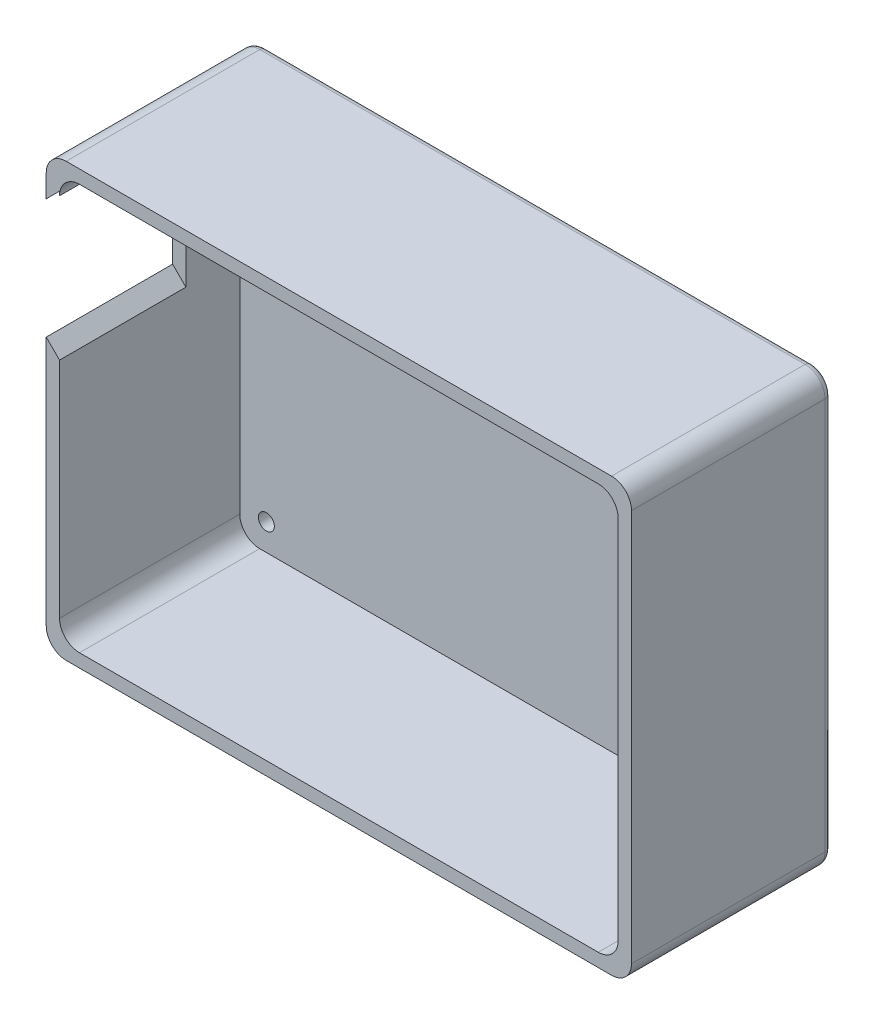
ISO-10303-21;
HEADER;
FILE_DESCRIPTION(('STEP AP214'),'2;1');
FILE_NAME('part.step','',(''),(''),'','','');
FILE_SCHEMA(('AUTOMOTIVE_DESIGN { 1 0 10303 214 1 1 1 1 }'));
ENDSEC;
DATA;
#1=APPLICATION_CONTEXT('core data for automotive mechanical design processes');
#2=APPLICATION_PROTOCOL_DEFINITION('international standard','automotive_design',2000,#1);
#3=PRODUCT_CONTEXT('',#1,'mechanical');
#4=PRODUCT('Part','Part','',(#3));
#5=PRODUCT_RELATED_PRODUCT_CATEGORY('part','',(#4));
#6=PRODUCT_DEFINITION_FORMATION('','',#4);
#7=PRODUCT_DEFINITION_CONTEXT('part definition',#1,'design');
#8=PRODUCT_DEFINITION('design','',#6,#7);
#9=PRODUCT_DEFINITION_SHAPE('','',#8);
#10=(LENGTH_UNIT() NAMED_UNIT(*) SI_UNIT(.MILLI.,.METRE.));
#11=(NAMED_UNIT(*) PLANE_ANGLE_UNIT() SI_UNIT($,.RADIAN.));
#12=(NAMED_UNIT(*) SI_UNIT($,.STERADIAN.) SOLID_ANGLE_UNIT());
#13=UNCERTAINTY_MEASURE_WITH_UNIT(LENGTH_MEASURE(1.E-05),#10,'distance_accuracy_value','');
#14=(GEOMETRIC_REPRESENTATION_CONTEXT(3) GLOBAL_UNCERTAINTY_ASSIGNED_CONTEXT((#13)) GLOBAL_UNIT_ASSIGNED_CONTEXT((#10,
#11,#12)) REPRESENTATION_CONTEXT('',''));
#15=CARTESIAN_POINT('',(0.,0.,0.));
#16=DIRECTION('',(0.,0.,1.));
#17=DIRECTION('',(1.,0.,0.));
#18=AXIS2_PLACEMENT_3D('',#15,#16,#17);
#19=CARTESIAN_POINT('',(82.,0.,3.));
#20=DIRECTION('',(0.,0.,-1.));
#21=DIRECTION('',(-1.,0.,0.));
#22=AXIS2_PLACEMENT_3D('',#19,#20,#21);
#23=CYLINDRICAL_SURFACE('',#22,3.);
#24=DIRECTION('',(0.,0.,-1.));
#25=VECTOR('',#24,1.);
#26=CARTESIAN_POINT('',(82.,-3.,3.));
#27=LINE('',#26,#25);
#28=CARTESIAN_POINT('',(82.,-3.,30.1));
#29=VERTEX_POINT('',#28);
#30=CARTESIAN_POINT('',(82.,-3.,1.));
#31=VERTEX_POINT('',#30);
#32=EDGE_CURVE('E420',#29,#31,#27,.T.);
#33=ORIENTED_EDGE('',*,*,#32,.T.);
#34=CARTESIAN_POINT('',(82.,0.,1.));
#35=DIRECTION('',(0.,0.,-1.));
#36=DIRECTION('',(-1.,0.,0.));
#37=AXIS2_PLACEMENT_3D('',#34,#35,#36);
#38=CIRCLE('',#37,3.);
#39=CARTESIAN_POINT('',(85.,0.,1.));
#40=VERTEX_POINT('',#39);
#41=EDGE_CURVE('E490',#31,#40,#38,.F.);
#42=ORIENTED_EDGE('',*,*,#41,.T.);
#43=DIRECTION('',(0.,0.,-1.));
#44=VECTOR('',#43,1.);
#45=CARTESIAN_POINT('',(85.,0.,3.));
#46=LINE('',#45,#44);
#47=CARTESIAN_POINT('',(85.,0.,30.1));
#48=VERTEX_POINT('',#47);
#49=EDGE_CURVE('E421',#48,#40,#46,.T.);
#50=ORIENTED_EDGE('',*,*,#49,.F.);
#51=CARTESIAN_POINT('',(82.,0.,30.1));
#52=DIRECTION('',(0.,0.,1.));
#53=DIRECTION('',(1.,0.,0.));
#54=AXIS2_PLACEMENT_3D('',#51,#52,#53);
#55=CIRCLE('',#54,3.);
#56=EDGE_CURVE('E363',#29,#48,#55,.T.);
#57=ORIENTED_EDGE('',*,*,#56,.F.);
#58=EDGE_LOOP('',(#33,#42,#50,#57));
#59=FACE_BOUND('',#58,.T.);
#60=ADVANCED_FACE('F39',(#59),#23,.T.);
#61=CARTESIAN_POINT('',(85.,59.,3.));
#62=DIRECTION('',(1.,0.,0.));
#63=DIRECTION('',(0.,0.,-1.));
#64=AXIS2_PLACEMENT_3D('',#61,#62,#63);
#65=PLANE('',#64);
#66=ORIENTED_EDGE('',*,*,#49,.T.);
#67=DIRECTION('',(0.,-1.,0.));
#68=VECTOR('',#67,1.);
#69=CARTESIAN_POINT('',(85.,59.,1.));
#70=LINE('',#69,#68);
#71=CARTESIAN_POINT('',(85.,59.,1.));
#72=VERTEX_POINT('',#71);
#73=EDGE_CURVE('E493',#40,#72,#70,.F.);
#74=ORIENTED_EDGE('',*,*,#73,.T.);
#75=DIRECTION('',(0.,0.,-1.));
#76=VECTOR('',#75,1.);
#77=CARTESIAN_POINT('',(85.,59.,3.));
#78=LINE('',#77,#76);
#79=CARTESIAN_POINT('',(85.,59.,30.1));
#80=VERTEX_POINT('',#79);
#81=EDGE_CURVE('E426',#80,#72,#78,.T.);
#82=ORIENTED_EDGE('',*,*,#81,.F.);
#83=DIRECTION('',(0.,1.,0.));
#84=VECTOR('',#83,1.);
#85=CARTESIAN_POINT('',(85.,0.,30.1));
#86=LINE('',#85,#84);
#87=EDGE_CURVE('E367',#48,#80,#86,.T.);
#88=ORIENTED_EDGE('',*,*,#87,.F.);
#89=EDGE_LOOP('',(#66,#74,#82,#88));
#90=FACE_BOUND('',#89,.T.);
#91=ADVANCED_FACE('F540',(#90),#65,.T.);
#92=CARTESIAN_POINT('',(82.,59.,3.));
#93=DIRECTION('',(0.,0.,-1.));
#94=DIRECTION('',(-1.,0.,0.));
#95=AXIS2_PLACEMENT_3D('',#92,#93,#94);
#96=CYLINDRICAL_SURFACE('',#95,3.);
#97=ORIENTED_EDGE('',*,*,#81,.T.);
#98=CARTESIAN_POINT('',(82.,59.,1.));
#99=DIRECTION('',(0.,0.,-1.));
#100=DIRECTION('',(-1.,0.,0.));
#101=AXIS2_PLACEMENT_3D('',#98,#99,#100);
#102=CIRCLE('',#101,3.);
#103=CARTESIAN_POINT('',(82.,62.,1.));
#104=VERTEX_POINT('',#103);
#105=EDGE_CURVE('E49',#72,#104,#102,.F.);
#106=ORIENTED_EDGE('',*,*,#105,.T.);
#107=DIRECTION('',(0.,0.,-1.));
#108=VECTOR('',#107,1.);
#109=CARTESIAN_POINT('',(82.,62.,3.));
#110=LINE('',#109,#108);
#111=CARTESIAN_POINT('',(82.,62.,30.1));
#112=VERTEX_POINT('',#111);
#113=EDGE_CURVE('E430',#112,#104,#110,.T.);
#114=ORIENTED_EDGE('',*,*,#113,.F.);
#115=CARTESIAN_POINT('',(82.,59.,30.1));
#116=DIRECTION('',(0.,0.,1.));
#117=DIRECTION('',(1.,0.,0.));
#118=AXIS2_PLACEMENT_3D('',#115,#116,#117);
#119=CIRCLE('',#118,3.);
#120=EDGE_CURVE('E339',#80,#112,#119,.T.);
#121=ORIENTED_EDGE('',*,*,#120,.F.);
#122=EDGE_LOOP('',(#97,#106,#114,#121));
#123=FACE_BOUND('',#122,.T.);
#124=ADVANCED_FACE('F545',(#123),#96,.T.);
#125=CARTESIAN_POINT('',(82.,62.,3.));
#126=DIRECTION('',(0.,1.,0.));
#127=DIRECTION('',(0.,0.,1.));
#128=AXIS2_PLACEMENT_3D('',#125,#126,#127);
#129=PLANE('',#128);
#130=ORIENTED_EDGE('',*,*,#113,.T.);
#131=DIRECTION('',(1.,0.,0.));
#132=VECTOR('',#131,1.);
#133=CARTESIAN_POINT('',(82.,62.,1.));
#134=LINE('',#133,#132);
#135=CARTESIAN_POINT('',(0.,62.,1.));
#136=VERTEX_POINT('',#135);
#137=EDGE_CURVE('E11',#104,#136,#134,.F.);
#138=ORIENTED_EDGE('',*,*,#137,.T.);
#139=DIRECTION('',(0.,0.,-1.));
#140=VECTOR('',#139,1.);
#141=CARTESIAN_POINT('',(0.,62.,3.));
#142=LINE('',#141,#140);
#143=CARTESIAN_POINT('',(0.,62.,30.1));
#144=VERTEX_POINT('',#143);
#145=EDGE_CURVE('E434',#144,#136,#142,.T.);
#146=ORIENTED_EDGE('',*,*,#145,.F.);
#147=DIRECTION('',(-1.,0.,0.));
#148=VECTOR('',#147,1.);
#149=CARTESIAN_POINT('',(82.,62.,30.1));
#150=LINE('',#149,#148);
#151=EDGE_CURVE('E343',#112,#144,#150,.T.);
#152=ORIENTED_EDGE('',*,*,#151,.F.);
#153=EDGE_LOOP('',(#130,#138,#146,#152));
#154=FACE_BOUND('',#153,.T.);
#155=ADVANCED_FACE('F551',(#154),#129,.T.);
#156=CARTESIAN_POINT('',(0.,59.,3.));
#157=DIRECTION('',(0.,0.,-1.));
#158=DIRECTION('',(-1.,0.,0.));
#159=AXIS2_PLACEMENT_3D('',#156,#157,#158);
#160=CYLINDRICAL_SURFACE('',#159,3.);
#161=ORIENTED_EDGE('',*,*,#145,.T.);
#162=CARTESIAN_POINT('',(0.,59.,1.));
#163=DIRECTION('',(0.,0.,-1.));
#164=DIRECTION('',(-1.,0.,0.));
#165=AXIS2_PLACEMENT_3D('',#162,#163,#164);
#166=CIRCLE('',#165,3.);
#167=CARTESIAN_POINT('',(-3.,59.,1.));
#168=VERTEX_POINT('',#167);
#169=EDGE_CURVE('E477',#136,#168,#166,.F.);
#170=ORIENTED_EDGE('',*,*,#169,.T.);
#171=DIRECTION('',(0.,0.,-1.));
#172=VECTOR('',#171,1.);
#173=CARTESIAN_POINT('',(-3.,59.,3.));
#174=LINE('',#173,#172);
#175=CARTESIAN_POINT('',(-3.,59.,30.1));
#176=VERTEX_POINT('',#175);
#177=EDGE_CURVE('E438',#176,#168,#174,.T.);
#178=ORIENTED_EDGE('',*,*,#177,.F.);
#179=CARTESIAN_POINT('',(0.,59.,30.1));
#180=DIRECTION('',(0.,0.,1.));
#181=DIRECTION('',(1.,0.,0.));
#182=AXIS2_PLACEMENT_3D('',#179,#180,#181);
#183=CIRCLE('',#182,3.);
#184=EDGE_CURVE('E347',#144,#176,#183,.T.);
#185=ORIENTED_EDGE('',*,*,#184,.F.);
#186=EDGE_LOOP('',(#161,#170,#178,#185));
#187=FACE_BOUND('',#186,.T.);
#188=ADVANCED_FACE('F554',(#187),#160,.T.);
#189=CARTESIAN_POINT('',(-3.,59.,3.));
#190=DIRECTION('',(-1.,0.,0.));
#191=DIRECTION('',(0.,0.,1.));
#192=AXIS2_PLACEMENT_3D('',#189,#190,#191);
#193=PLANE('',#192);
#194=DIRECTION('',(0.,0.,1.));
#195=VECTOR('',#194,1.);
#196=CARTESIAN_POINT('',(-3.,55.60496316,11.1));
#197=LINE('',#196,#195);
#198=CARTESIAN_POINT('',(-3.,55.60496316,11.1));
#199=VERTEX_POINT('',#198);
#200=CARTESIAN_POINT('',(-3.,55.60496316,30.1));
#201=VERTEX_POINT('',#200);
#202=EDGE_CURVE('E207',#199,#201,#197,.T.);
#203=ORIENTED_EDGE('',*,*,#202,.T.);
#204=DIRECTION('',(0.,-1.,0.));
#205=VECTOR('',#204,1.);
#206=CARTESIAN_POINT('',(-3.,0.,30.1));
#207=LINE('',#206,#205);
#208=EDGE_CURVE('E352',#176,#201,#207,.T.);
#209=ORIENTED_EDGE('',*,*,#208,.F.);
#210=ORIENTED_EDGE('',*,*,#177,.T.);
#211=DIRECTION('',(0.,1.,0.));
#212=VECTOR('',#211,1.);
#213=CARTESIAN_POINT('',(-3.,59.,1.));
#214=LINE('',#213,#212);
#215=CARTESIAN_POINT('',(-3.,0.,1.));
#216=VERTEX_POINT('',#215);
#217=EDGE_CURVE('E481',#168,#216,#214,.F.);
#218=ORIENTED_EDGE('',*,*,#217,.T.);
#219=DIRECTION('',(0.,0.,-1.));
#220=VECTOR('',#219,1.);
#221=CARTESIAN_POINT('',(-3.,0.,3.));
#222=LINE('',#221,#220);
#223=CARTESIAN_POINT('',(-3.,0.,30.1));
#224=VERTEX_POINT('',#223);
#225=EDGE_CURVE('E442',#224,#216,#222,.T.);
#226=ORIENTED_EDGE('',*,*,#225,.F.);
#227=CARTESIAN_POINT('',(-3.,37.60496316,30.1));
#228=VERTEX_POINT('',#227);
#229=EDGE_CURVE('E351',#228,#224,#207,.T.);
#230=ORIENTED_EDGE('',*,*,#229,.F.);
#231=DIRECTION('',(0.,0.,1.));
#232=VECTOR('',#231,1.);
#233=CARTESIAN_POINT('',(-3.,37.60496316,11.1));
#234=LINE('',#233,#232);
#235=CARTESIAN_POINT('',(-3.,37.60496316,11.1));
#236=VERTEX_POINT('',#235);
#237=EDGE_CURVE('E219',#236,#228,#234,.T.);
#238=ORIENTED_EDGE('',*,*,#237,.F.);
#239=DIRECTION('',(0.,-1.,0.));
#240=VECTOR('',#239,1.);
#241=CARTESIAN_POINT('',(-3.,55.60496316,11.1));
#242=LINE('',#241,#240);
#243=EDGE_CURVE('E223',#199,#236,#242,.T.);
#244=ORIENTED_EDGE('',*,*,#243,.F.);
#245=EDGE_LOOP('',(#203,#209,#210,#218,#226,#230,#238,#244));
#246=FACE_BOUND('',#245,.T.);
#247=ADVANCED_FACE('F230',(#246),#193,.T.);
#248=CARTESIAN_POINT('',(0.,0.,3.));
#249=DIRECTION('',(0.,0.,-1.));
#250=DIRECTION('',(-1.,0.,0.));
#251=AXIS2_PLACEMENT_3D('',#248,#249,#250);
#252=CYLINDRICAL_SURFACE('',#251,3.);
#253=ORIENTED_EDGE('',*,*,#225,.T.);
#254=CARTESIAN_POINT('',(0.,0.,1.));
#255=DIRECTION('',(0.,0.,-1.));
#256=DIRECTION('',(-1.,0.,0.));
#257=AXIS2_PLACEMENT_3D('',#254,#255,#256);
#258=CIRCLE('',#257,3.);
#259=CARTESIAN_POINT('',(0.,-3.,1.));
#260=VERTEX_POINT('',#259);
#261=EDGE_CURVE('E484',#216,#260,#258,.F.);
#262=ORIENTED_EDGE('',*,*,#261,.T.);
#263=DIRECTION('',(0.,0.,-1.));
#264=VECTOR('',#263,1.);
#265=CARTESIAN_POINT('',(0.,-3.,3.));
#266=LINE('',#265,#264);
#267=CARTESIAN_POINT('',(0.,-3.,30.1));
#268=VERTEX_POINT('',#267);
#269=EDGE_CURVE('E446',#268,#260,#266,.T.);
#270=ORIENTED_EDGE('',*,*,#269,.F.);
#271=CARTESIAN_POINT('',(0.,0.,30.1));
#272=DIRECTION('',(0.,0.,1.));
#273=DIRECTION('',(-1.,0.,0.));
#274=AXIS2_PLACEMENT_3D('',#271,#272,#273);
#275=CIRCLE('',#274,3.);
#276=EDGE_CURVE('E355',#224,#268,#275,.T.);
#277=ORIENTED_EDGE('',*,*,#276,.F.);
#278=EDGE_LOOP('',(#253,#262,#270,#277));
#279=FACE_BOUND('',#278,.T.);
#280=ADVANCED_FACE('F606',(#279),#252,.T.);
#281=CARTESIAN_POINT('',(82.,-3.,3.));
#282=DIRECTION('',(0.,-1.,0.));
#283=DIRECTION('',(0.,0.,-1.));
#284=AXIS2_PLACEMENT_3D('',#281,#282,#283);
#285=PLANE('',#284);
#286=ORIENTED_EDGE('',*,*,#269,.T.);
#287=DIRECTION('',(-1.,0.,0.));
#288=VECTOR('',#287,1.);
#289=CARTESIAN_POINT('',(82.,-3.,1.));
#290=LINE('',#289,#288);
#291=EDGE_CURVE('E487',#260,#31,#290,.F.);
#292=ORIENTED_EDGE('',*,*,#291,.T.);
#293=ORIENTED_EDGE('',*,*,#32,.F.);
#294=DIRECTION('',(1.,0.,0.));
#295=VECTOR('',#294,1.);
#296=CARTESIAN_POINT('',(82.,-3.,30.1));
#297=LINE('',#296,#295);
#298=EDGE_CURVE('E359',#268,#29,#297,.T.);
#299=ORIENTED_EDGE('',*,*,#298,.F.);
#300=EDGE_LOOP('',(#286,#292,#293,#299));
#301=FACE_BOUND('',#300,.T.);
#302=ADVANCED_FACE('F609',(#301),#285,.T.);
#303=CARTESIAN_POINT('',(3.,3.,0.));
#304=DIRECTION('',(0.,0.,-1.));
#305=DIRECTION('',(-1.,0.,0.));
#306=AXIS2_PLACEMENT_3D('',#303,#304,#305);
#307=PLANE('',#306);
#308=DIRECTION('',(0.,1.,0.));
#309=VECTOR('',#308,1.);
#310=CARTESIAN_POINT('',(-2.,3.,0.));
#311=LINE('',#310,#309);
#312=CARTESIAN_POINT('',(-2.,0.,0.));
#313=VERTEX_POINT('',#312);
#314=CARTESIAN_POINT('',(-2.,59.,0.));
#315=VERTEX_POINT('',#314);
#316=EDGE_CURVE('E470',#313,#315,#311,.T.);
#317=ORIENTED_EDGE('',*,*,#316,.T.);
#318=CARTESIAN_POINT('',(0.,59.,0.));
#319=DIRECTION('',(0.,0.,-1.));
#320=DIRECTION('',(-1.,0.,0.));
#321=AXIS2_PLACEMENT_3D('',#318,#319,#320);
#322=CIRCLE('',#321,2.);
#323=CARTESIAN_POINT('',(0.,61.,0.));
#324=VERTEX_POINT('',#323);
#325=EDGE_CURVE('E473',#315,#324,#322,.T.);
#326=ORIENTED_EDGE('',*,*,#325,.T.);
#327=DIRECTION('',(1.,0.,0.));
#328=VECTOR('',#327,1.);
#329=CARTESIAN_POINT('',(3.,61.,0.));
#330=LINE('',#329,#328);
#331=CARTESIAN_POINT('',(82.,61.,0.));
#332=VERTEX_POINT('',#331);
#333=EDGE_CURVE('E425',#324,#332,#330,.T.);
#334=ORIENTED_EDGE('',*,*,#333,.T.);
#335=CARTESIAN_POINT('',(82.,59.,0.));
#336=DIRECTION('',(0.,0.,-1.));
#337=DIRECTION('',(-1.,0.,0.));
#338=AXIS2_PLACEMENT_3D('',#335,#336,#337);
#339=CIRCLE('',#338,2.);
#340=CARTESIAN_POINT('',(84.,59.,0.));
#341=VERTEX_POINT('',#340);
#342=EDGE_CURVE('E455',#332,#341,#339,.T.);
#343=ORIENTED_EDGE('',*,*,#342,.T.);
#344=DIRECTION('',(0.,-1.,0.));
#345=VECTOR('',#344,1.);
#346=CARTESIAN_POINT('',(84.,3.,0.));
#347=LINE('',#346,#345);
#348=CARTESIAN_POINT('',(84.,0.,0.));
#349=VERTEX_POINT('',#348);
#350=EDGE_CURVE('E458',#341,#349,#347,.T.);
#351=ORIENTED_EDGE('',*,*,#350,.T.);
#352=CARTESIAN_POINT('',(82.,0.,0.));
#353=DIRECTION('',(0.,0.,-1.));
#354=DIRECTION('',(-1.,0.,0.));
#355=AXIS2_PLACEMENT_3D('',#352,#353,#354);
#356=CIRCLE('',#355,2.);
#357=CARTESIAN_POINT('',(82.,-2.,0.));
#358=VERTEX_POINT('',#357);
#359=EDGE_CURVE('E461',#349,#358,#356,.T.);
#360=ORIENTED_EDGE('',*,*,#359,.T.);
#361=DIRECTION('',(-1.,0.,0.));
#362=VECTOR('',#361,1.);
#363=CARTESIAN_POINT('',(3.,-2.,0.));
#364=LINE('',#363,#362);
#365=CARTESIAN_POINT('',(0.,-2.,0.));
#366=VERTEX_POINT('',#365);
#367=EDGE_CURVE('E464',#358,#366,#364,.T.);
#368=ORIENTED_EDGE('',*,*,#367,.T.);
#369=CARTESIAN_POINT('',(0.,0.,0.));
#370=DIRECTION('',(0.,0.,-1.));
#371=DIRECTION('',(-1.,0.,0.));
#372=AXIS2_PLACEMENT_3D('',#369,#370,#371);
#373=CIRCLE('',#372,2.);
#374=EDGE_CURVE('E467',#366,#313,#373,.T.);
#375=ORIENTED_EDGE('',*,*,#374,.T.);
#376=EDGE_LOOP('',(#317,#326,#334,#343,#351,#360,#368,#375));
#377=FACE_BOUND('',#376,.T.);
#378=CARTESIAN_POINT('',(79.,56.,0.));
#379=DIRECTION('',(0.,0.,-1.));
#380=DIRECTION('',(-1.,0.,0.));
#381=AXIS2_PLACEMENT_3D('',#378,#379,#380);
#382=CIRCLE('',#381,2.19999999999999);
#383=CARTESIAN_POINT('',(76.8,56.,0.));
#384=VERTEX_POINT('',#383);
#385=EDGE_CURVE('E372',#384,#384,#382,.T.);
#386=ORIENTED_EDGE('',*,*,#385,.F.);
#387=EDGE_LOOP('',(#386));
#388=FACE_BOUND('',#387,.T.);
#389=CARTESIAN_POINT('',(3.,56.,0.));
#390=DIRECTION('',(0.,0.,-1.));
#391=DIRECTION('',(-1.,0.,0.));
#392=AXIS2_PLACEMENT_3D('',#389,#390,#391);
#393=CIRCLE('',#392,2.2);
#394=CARTESIAN_POINT('',(0.800000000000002,56.,0.));
#395=VERTEX_POINT('',#394);
#396=EDGE_CURVE('E384',#395,#395,#393,.T.);
#397=ORIENTED_EDGE('',*,*,#396,.F.);
#398=EDGE_LOOP('',(#397));
#399=FACE_BOUND('',#398,.T.);
#400=CARTESIAN_POINT('',(3.,3.,0.));
#401=DIRECTION('',(0.,0.,-1.));
#402=DIRECTION('',(-1.,0.,0.));
#403=AXIS2_PLACEMENT_3D('',#400,#401,#402);
#404=CIRCLE('',#403,2.2);
#405=CARTESIAN_POINT('',(0.799999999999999,3.,0.));
#406=VERTEX_POINT('',#405);
#407=EDGE_CURVE('E396',#406,#406,#404,.T.);
#408=ORIENTED_EDGE('',*,*,#407,.F.);
#409=EDGE_LOOP('',(#408));
#410=FACE_BOUND('',#409,.T.);
#411=CARTESIAN_POINT('',(79.,3.,0.));
#412=DIRECTION('',(0.,0.,-1.));
#413=DIRECTION('',(-1.,0.,0.));
#414=AXIS2_PLACEMENT_3D('',#411,#412,#413);
#415=CIRCLE('',#414,2.19999999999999);
#416=CARTESIAN_POINT('',(76.8,3.,0.));
#417=VERTEX_POINT('',#416);
#418=EDGE_CURVE('E408',#417,#417,#415,.T.);
#419=ORIENTED_EDGE('',*,*,#418,.F.);
#420=EDGE_LOOP('',(#419));
#421=FACE_BOUND('',#420,.T.);
#422=ADVANCED_FACE('F611',(#377,#388,#399,#410,#421),#307,.T.);
#423=CARTESIAN_POINT('',(3.,3.,3.));
#424=DIRECTION('',(0.,0.,-1.));
#425=DIRECTION('',(-1.,0.,0.));
#426=AXIS2_PLACEMENT_3D('',#423,#424,#425);
#427=PLANE('',#426);
#428=DIRECTION('',(0.,1.,0.));
#429=VECTOR('',#428,1.);
#430=CARTESIAN_POINT('',(83.,2.00000000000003,3.));
#431=LINE('',#430,#429);
#432=CARTESIAN_POINT('',(83.,2.00000000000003,3.));
#433=VERTEX_POINT('',#432);
#434=CARTESIAN_POINT('',(83.,57.,3.));
#435=VERTEX_POINT('',#434);
#436=EDGE_CURVE('E260',#433,#435,#431,.T.);
#437=ORIENTED_EDGE('',*,*,#436,.T.);
#438=CARTESIAN_POINT('',(80.,57.,3.));
#439=DIRECTION('',(0.,0.,1.));
#440=DIRECTION('',(1.,0.,0.));
#441=AXIS2_PLACEMENT_3D('',#438,#439,#440);
#442=CIRCLE('',#441,3.);
#443=CARTESIAN_POINT('',(80.,60.,3.));
#444=VERTEX_POINT('',#443);
#445=EDGE_CURVE('E249',#435,#444,#442,.T.);
#446=ORIENTED_EDGE('',*,*,#445,.T.);
#447=DIRECTION('',(-1.,0.,0.));
#448=VECTOR('',#447,1.);
#449=CARTESIAN_POINT('',(80.,60.,3.));
#450=LINE('',#449,#448);
#451=CARTESIAN_POINT('',(2.00000000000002,60.,3.));
#452=VERTEX_POINT('',#451);
#453=EDGE_CURVE('E286',#444,#452,#450,.T.);
#454=ORIENTED_EDGE('',*,*,#453,.T.);
#455=CARTESIAN_POINT('',(2.,57.,3.));
#456=DIRECTION('',(0.,0.,1.));
#457=DIRECTION('',(1.,0.,0.));
#458=AXIS2_PLACEMENT_3D('',#455,#456,#457);
#459=CIRCLE('',#458,3.);
#460=CARTESIAN_POINT('',(-1.,57.,3.));
#461=VERTEX_POINT('',#460);
#462=EDGE_CURVE('E290',#452,#461,#459,.T.);
#463=ORIENTED_EDGE('',*,*,#462,.T.);
#464=DIRECTION('',(0.,-1.,0.));
#465=VECTOR('',#464,1.);
#466=CARTESIAN_POINT('',(-1.,2.00000000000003,3.));
#467=LINE('',#466,#465);
#468=CARTESIAN_POINT('',(-1.,2.00000000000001,3.));
#469=VERTEX_POINT('',#468);
#470=EDGE_CURVE('E294',#461,#469,#467,.T.);
#471=ORIENTED_EDGE('',*,*,#470,.T.);
#472=CARTESIAN_POINT('',(2.,2.00000000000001,3.));
#473=DIRECTION('',(0.,0.,1.));
#474=DIRECTION('',(-1.,0.,0.));
#475=AXIS2_PLACEMENT_3D('',#472,#473,#474);
#476=CIRCLE('',#475,3.);
#477=CARTESIAN_POINT('',(2.00000000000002,-0.999999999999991,3.));
#478=VERTEX_POINT('',#477);
#479=EDGE_CURVE('E298',#469,#478,#476,.T.);
#480=ORIENTED_EDGE('',*,*,#479,.T.);
#481=DIRECTION('',(1.,0.,0.));
#482=VECTOR('',#481,1.);
#483=CARTESIAN_POINT('',(80.,-0.999999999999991,3.));
#484=LINE('',#483,#482);
#485=CARTESIAN_POINT('',(80.,-0.999999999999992,3.));
#486=VERTEX_POINT('',#485);
#487=EDGE_CURVE('E302',#478,#486,#484,.T.);
#488=ORIENTED_EDGE('',*,*,#487,.T.);
#489=CARTESIAN_POINT('',(80.,2.00000000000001,3.));
#490=DIRECTION('',(0.,0.,1.));
#491=DIRECTION('',(1.,0.,0.));
#492=AXIS2_PLACEMENT_3D('',#489,#490,#491);
#493=CIRCLE('',#492,3.);
#494=EDGE_CURVE('E306',#486,#433,#493,.T.);
#495=ORIENTED_EDGE('',*,*,#494,.T.);
#496=EDGE_LOOP('',(#437,#446,#454,#463,#471,#480,#488,#495));
#497=FACE_BOUND('',#496,.T.);
#498=CARTESIAN_POINT('',(79.,56.,3.));
#499=DIRECTION('',(0.,0.,-1.));
#500=DIRECTION('',(-1.,0.,0.));
#501=AXIS2_PLACEMENT_3D('',#498,#499,#500);
#502=CIRCLE('',#501,1.19999999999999);
#503=CARTESIAN_POINT('',(77.8,56.,3.));
#504=VERTEX_POINT('',#503);
#505=EDGE_CURVE('E380',#504,#504,#502,.T.);
#506=ORIENTED_EDGE('',*,*,#505,.T.);
#507=EDGE_LOOP('',(#506));
#508=FACE_BOUND('',#507,.T.);
#509=CARTESIAN_POINT('',(3.,56.,3.));
#510=DIRECTION('',(0.,0.,-1.));
#511=DIRECTION('',(-1.,0.,0.));
#512=AXIS2_PLACEMENT_3D('',#509,#510,#511);
#513=CIRCLE('',#512,1.2);
#514=CARTESIAN_POINT('',(1.8,56.,3.));
#515=VERTEX_POINT('',#514);
#516=EDGE_CURVE('E392',#515,#515,#513,.T.);
#517=ORIENTED_EDGE('',*,*,#516,.T.);
#518=EDGE_LOOP('',(#517));
#519=FACE_BOUND('',#518,.T.);
#520=CARTESIAN_POINT('',(3.,3.,3.));
#521=DIRECTION('',(0.,0.,-1.));
#522=DIRECTION('',(-1.,0.,0.));
#523=AXIS2_PLACEMENT_3D('',#520,#521,#522);
#524=CIRCLE('',#523,1.2);
#525=CARTESIAN_POINT('',(1.8,3.,3.));
#526=VERTEX_POINT('',#525);
#527=EDGE_CURVE('E404',#526,#526,#524,.T.);
#528=ORIENTED_EDGE('',*,*,#527,.T.);
#529=EDGE_LOOP('',(#528));
#530=FACE_BOUND('',#529,.T.);
#531=CARTESIAN_POINT('',(79.,3.,3.));
#532=DIRECTION('',(0.,0.,-1.));
#533=DIRECTION('',(-1.,0.,0.));
#534=AXIS2_PLACEMENT_3D('',#531,#532,#533);
#535=CIRCLE('',#534,1.19999999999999);
#536=CARTESIAN_POINT('',(77.8,3.,3.));
#537=VERTEX_POINT('',#536);
#538=EDGE_CURVE('E416',#537,#537,#535,.T.);
#539=ORIENTED_EDGE('',*,*,#538,.T.);
#540=EDGE_LOOP('',(#539));
#541=FACE_BOUND('',#540,.T.);
#542=ADVANCED_FACE('F575',(#497,#508,#519,#530,#541),#427,.F.);
#543=CARTESIAN_POINT('',(79.,3.,0.));
#544=DIRECTION('',(0.,0.,-1.));
#545=DIRECTION('',(-1.,0.,0.));
#546=AXIS2_PLACEMENT_3D('',#543,#544,#545);
#547=CYLINDRICAL_SURFACE('',#546,1.2);
#548=ORIENTED_EDGE('',*,*,#538,.F.);
#549=EDGE_LOOP('',(#548));
#550=FACE_BOUND('',#549,.T.);
#551=CARTESIAN_POINT('',(79.,3.,1.));
#552=DIRECTION('',(0.,0.,-1.));
#553=DIRECTION('',(-1.,0.,0.));
#554=AXIS2_PLACEMENT_3D('',#551,#552,#553);
#555=CIRCLE('',#554,1.20000000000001);
#556=CARTESIAN_POINT('',(77.8,3.,1.));
#557=VERTEX_POINT('',#556);
#558=EDGE_CURVE('E412',#557,#557,#555,.T.);
#559=ORIENTED_EDGE('',*,*,#558,.T.);
#560=EDGE_LOOP('',(#559));
#561=FACE_BOUND('',#560,.T.);
#562=ADVANCED_FACE('F628',(#550,#561),#547,.F.);
#563=CARTESIAN_POINT('',(79.,3.,0.));
#564=DIRECTION('',(0.,0.,-1.));
#565=DIRECTION('',(-1.,0.,0.));
#566=AXIS2_PLACEMENT_3D('',#563,#564,#565);
#567=CONICAL_SURFACE('',#566,2.19999999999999,0.785398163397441);
#568=ORIENTED_EDGE('',*,*,#558,.F.);
#569=EDGE_LOOP('',(#568));
#570=FACE_BOUND('',#569,.T.);
#571=ORIENTED_EDGE('',*,*,#418,.T.);
#572=EDGE_LOOP('',(#571));
#573=FACE_BOUND('',#572,.T.);
#574=ADVANCED_FACE('F688',(#570,#573),#567,.F.);
#575=CARTESIAN_POINT('',(3.,3.,0.));
#576=DIRECTION('',(0.,0.,-1.));
#577=DIRECTION('',(-1.,0.,0.));
#578=AXIS2_PLACEMENT_3D('',#575,#576,#577);
#579=CYLINDRICAL_SURFACE('',#578,1.2);
#580=ORIENTED_EDGE('',*,*,#527,.F.);
#581=EDGE_LOOP('',(#580));
#582=FACE_BOUND('',#581,.T.);
#583=CARTESIAN_POINT('',(3.,3.,1.));
#584=DIRECTION('',(0.,0.,-1.));
#585=DIRECTION('',(-1.,0.,0.));
#586=AXIS2_PLACEMENT_3D('',#583,#584,#585);
#587=CIRCLE('',#586,1.2);
#588=CARTESIAN_POINT('',(1.8,3.,1.));
#589=VERTEX_POINT('',#588);
#590=EDGE_CURVE('E400',#589,#589,#587,.T.);
#591=ORIENTED_EDGE('',*,*,#590,.T.);
#592=EDGE_LOOP('',(#591));
#593=FACE_BOUND('',#592,.T.);
#594=ADVANCED_FACE('F684',(#582,#593),#579,.F.);
#595=CARTESIAN_POINT('',(3.,3.,0.));
#596=DIRECTION('',(0.,0.,-1.));
#597=DIRECTION('',(-1.,0.,0.));
#598=AXIS2_PLACEMENT_3D('',#595,#596,#597);
#599=CONICAL_SURFACE('',#598,2.2,0.785398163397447);
#600=ORIENTED_EDGE('',*,*,#590,.F.);
#601=EDGE_LOOP('',(#600));
#602=FACE_BOUND('',#601,.T.);
#603=ORIENTED_EDGE('',*,*,#407,.T.);
#604=EDGE_LOOP('',(#603));
#605=FACE_BOUND('',#604,.T.);
#606=ADVANCED_FACE('F680',(#602,#605),#599,.F.);
#607=CARTESIAN_POINT('',(3.,56.,0.));
#608=DIRECTION('',(0.,0.,-1.));
#609=DIRECTION('',(-1.,0.,0.));
#610=AXIS2_PLACEMENT_3D('',#607,#608,#609);
#611=CYLINDRICAL_SURFACE('',#610,1.2);
#612=ORIENTED_EDGE('',*,*,#516,.F.);
#613=EDGE_LOOP('',(#612));
#614=FACE_BOUND('',#613,.T.);
#615=CARTESIAN_POINT('',(3.,56.,1.));
#616=DIRECTION('',(0.,0.,-1.));
#617=DIRECTION('',(-1.,0.,0.));
#618=AXIS2_PLACEMENT_3D('',#615,#616,#617);
#619=CIRCLE('',#618,1.2);
#620=CARTESIAN_POINT('',(1.8,56.,1.));
#621=VERTEX_POINT('',#620);
#622=EDGE_CURVE('E388',#621,#621,#619,.T.);
#623=ORIENTED_EDGE('',*,*,#622,.T.);
#624=EDGE_LOOP('',(#623));
#625=FACE_BOUND('',#624,.T.);
#626=ADVANCED_FACE('F676',(#614,#625),#611,.F.);
#627=CARTESIAN_POINT('',(3.,56.,0.));
#628=DIRECTION('',(0.,0.,-1.));
#629=DIRECTION('',(-1.,0.,0.));
#630=AXIS2_PLACEMENT_3D('',#627,#628,#629);
#631=CONICAL_SURFACE('',#630,2.2,0.785398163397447);
#632=ORIENTED_EDGE('',*,*,#622,.F.);
#633=EDGE_LOOP('',(#632));
#634=FACE_BOUND('',#633,.T.);
#635=ORIENTED_EDGE('',*,*,#396,.T.);
#636=EDGE_LOOP('',(#635));
#637=FACE_BOUND('',#636,.T.);
#638=ADVANCED_FACE('F666',(#634,#637),#631,.F.);
#639=CARTESIAN_POINT('',(79.,56.,0.));
#640=DIRECTION('',(0.,0.,-1.));
#641=DIRECTION('',(-1.,0.,0.));
#642=AXIS2_PLACEMENT_3D('',#639,#640,#641);
#643=CYLINDRICAL_SURFACE('',#642,1.2);
#644=ORIENTED_EDGE('',*,*,#505,.F.);
#645=EDGE_LOOP('',(#644));
#646=FACE_BOUND('',#645,.T.);
#647=CARTESIAN_POINT('',(79.,56.,1.));
#648=DIRECTION('',(0.,0.,-1.));
#649=DIRECTION('',(-1.,0.,0.));
#650=AXIS2_PLACEMENT_3D('',#647,#648,#649);
#651=CIRCLE('',#650,1.20000000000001);
#652=CARTESIAN_POINT('',(77.8,56.,1.));
#653=VERTEX_POINT('',#652);
#654=EDGE_CURVE('E376',#653,#653,#651,.T.);
#655=ORIENTED_EDGE('',*,*,#654,.T.);
#656=EDGE_LOOP('',(#655));
#657=FACE_BOUND('',#656,.T.);
#658=ADVANCED_FACE('F660',(#646,#657),#643,.F.);
#659=CARTESIAN_POINT('',(79.,56.,0.));
#660=DIRECTION('',(0.,0.,-1.));
#661=DIRECTION('',(-1.,0.,0.));
#662=AXIS2_PLACEMENT_3D('',#659,#660,#661);
#663=CONICAL_SURFACE('',#662,2.19999999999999,0.785398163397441);
#664=ORIENTED_EDGE('',*,*,#654,.F.);
#665=EDGE_LOOP('',(#664));
#666=FACE_BOUND('',#665,.T.);
#667=ORIENTED_EDGE('',*,*,#385,.T.);
#668=EDGE_LOOP('',(#667));
#669=FACE_BOUND('',#668,.T.);
#670=ADVANCED_FACE('F656',(#666,#669),#663,.F.);
#671=CARTESIAN_POINT('',(82.,0.,1.));
#672=DIRECTION('',(0.,0.,-1.));
#673=DIRECTION('',(-1.,0.,0.));
#674=AXIS2_PLACEMENT_3D('',#671,#672,#673);
#675=TOROIDAL_SURFACE('',#674,2.,1.);
#676=CARTESIAN_POINT('',(84.,0.,1.));
#677=DIRECTION('',(0.,1.,0.));
#678=DIRECTION('',(-1.,0.,0.));
#679=AXIS2_PLACEMENT_3D('',#676,#677,#678);
#680=CIRCLE('',#679,1.);
#681=EDGE_CURVE('E518',#40,#349,#680,.T.);
#682=ORIENTED_EDGE('',*,*,#681,.F.);
#683=ORIENTED_EDGE('',*,*,#41,.F.);
#684=CARTESIAN_POINT('',(82.,-2.,1.));
#685=DIRECTION('',(-1.,0.,0.));
#686=DIRECTION('',(0.,0.,1.));
#687=AXIS2_PLACEMENT_3D('',#684,#685,#686);
#688=CIRCLE('',#687,1.);
#689=EDGE_CURVE('E43',#358,#31,#688,.T.);
#690=ORIENTED_EDGE('',*,*,#689,.F.);
#691=ORIENTED_EDGE('',*,*,#359,.F.);
#692=EDGE_LOOP('',(#682,#683,#690,#691));
#693=FACE_BOUND('',#692,.T.);
#694=ADVANCED_FACE('F41',(#693),#675,.T.);
#695=CARTESIAN_POINT('',(3.,-2.,1.));
#696=DIRECTION('',(-1.,0.,0.));
#697=DIRECTION('',(0.,0.,1.));
#698=AXIS2_PLACEMENT_3D('',#695,#696,#697);
#699=CYLINDRICAL_SURFACE('',#698,1.);
#700=ORIENTED_EDGE('',*,*,#689,.T.);
#701=ORIENTED_EDGE('',*,*,#291,.F.);
#702=CARTESIAN_POINT('',(0.,-2.,1.));
#703=DIRECTION('',(-1.,0.,0.));
#704=DIRECTION('',(0.,-1.,0.));
#705=AXIS2_PLACEMENT_3D('',#702,#703,#704);
#706=CIRCLE('',#705,1.);
#707=EDGE_CURVE('E515',#366,#260,#706,.T.);
#708=ORIENTED_EDGE('',*,*,#707,.F.);
#709=ORIENTED_EDGE('',*,*,#367,.F.);
#710=EDGE_LOOP('',(#700,#701,#708,#709));
#711=FACE_BOUND('',#710,.T.);
#712=ADVANCED_FACE('F531',(#711),#699,.T.);
#713=CARTESIAN_POINT('',(84.,3.,1.));
#714=DIRECTION('',(0.,-1.,0.));
#715=DIRECTION('',(0.,0.,-1.));
#716=AXIS2_PLACEMENT_3D('',#713,#714,#715);
#717=CYLINDRICAL_SURFACE('',#716,1.);
#718=ORIENTED_EDGE('',*,*,#681,.T.);
#719=ORIENTED_EDGE('',*,*,#350,.F.);
#720=CARTESIAN_POINT('',(84.,59.,1.));
#721=DIRECTION('',(0.,1.,0.));
#722=DIRECTION('',(0.,0.,1.));
#723=AXIS2_PLACEMENT_3D('',#720,#721,#722);
#724=CIRCLE('',#723,1.);
#725=EDGE_CURVE('E511',#72,#341,#724,.T.);
#726=ORIENTED_EDGE('',*,*,#725,.F.);
#727=ORIENTED_EDGE('',*,*,#73,.F.);
#728=EDGE_LOOP('',(#718,#719,#726,#727));
#729=FACE_BOUND('',#728,.T.);
#730=ADVANCED_FACE('F649',(#729),#717,.T.);
#731=CARTESIAN_POINT('',(0.,0.,1.));
#732=DIRECTION('',(0.,0.,-1.));
#733=DIRECTION('',(-1.,0.,0.));
#734=AXIS2_PLACEMENT_3D('',#731,#732,#733);
#735=TOROIDAL_SURFACE('',#734,2.,1.);
#736=ORIENTED_EDGE('',*,*,#707,.T.);
#737=ORIENTED_EDGE('',*,*,#261,.F.);
#738=CARTESIAN_POINT('',(-2.,0.,1.));
#739=DIRECTION('',(0.,1.,0.));
#740=DIRECTION('',(0.,0.,1.));
#741=AXIS2_PLACEMENT_3D('',#738,#739,#740);
#742=CIRCLE('',#741,1.);
#743=EDGE_CURVE('E507',#313,#216,#742,.T.);
#744=ORIENTED_EDGE('',*,*,#743,.F.);
#745=ORIENTED_EDGE('',*,*,#374,.F.);
#746=EDGE_LOOP('',(#736,#737,#744,#745));
#747=FACE_BOUND('',#746,.T.);
#748=ADVANCED_FACE('F645',(#747),#735,.T.);
#749=CARTESIAN_POINT('',(82.,59.,1.));
#750=DIRECTION('',(0.,0.,-1.));
#751=DIRECTION('',(-1.,0.,0.));
#752=AXIS2_PLACEMENT_3D('',#749,#750,#751);
#753=TOROIDAL_SURFACE('',#752,2.,1.);
#754=ORIENTED_EDGE('',*,*,#725,.T.);
#755=ORIENTED_EDGE('',*,*,#342,.F.);
#756=CARTESIAN_POINT('',(82.,61.,1.));
#757=DIRECTION('',(-1.,0.,0.));
#758=DIRECTION('',(0.,0.,1.));
#759=AXIS2_PLACEMENT_3D('',#756,#757,#758);
#760=CIRCLE('',#759,1.);
#761=EDGE_CURVE('E503',#104,#332,#760,.T.);
#762=ORIENTED_EDGE('',*,*,#761,.F.);
#763=ORIENTED_EDGE('',*,*,#105,.F.);
#764=EDGE_LOOP('',(#754,#755,#762,#763));
#765=FACE_BOUND('',#764,.T.);
#766=ADVANCED_FACE('F641',(#765),#753,.T.);
#767=CARTESIAN_POINT('',(-2.,3.,1.));
#768=DIRECTION('',(0.,1.,0.));
#769=DIRECTION('',(0.,0.,1.));
#770=AXIS2_PLACEMENT_3D('',#767,#768,#769);
#771=CYLINDRICAL_SURFACE('',#770,1.);
#772=ORIENTED_EDGE('',*,*,#743,.T.);
#773=ORIENTED_EDGE('',*,*,#217,.F.);
#774=CARTESIAN_POINT('',(-2.,59.,1.));
#775=DIRECTION('',(0.,1.,0.));
#776=DIRECTION('',(-1.,0.,0.));
#777=AXIS2_PLACEMENT_3D('',#774,#775,#776);
#778=CIRCLE('',#777,1.);
#779=EDGE_CURVE('E500',#315,#168,#778,.T.);
#780=ORIENTED_EDGE('',*,*,#779,.F.);
#781=ORIENTED_EDGE('',*,*,#316,.F.);
#782=EDGE_LOOP('',(#772,#773,#780,#781));
#783=FACE_BOUND('',#782,.T.);
#784=ADVANCED_FACE('F637',(#783),#771,.T.);
#785=CARTESIAN_POINT('',(3.,61.,1.));
#786=DIRECTION('',(1.,0.,0.));
#787=DIRECTION('',(0.,0.,-1.));
#788=AXIS2_PLACEMENT_3D('',#785,#786,#787);
#789=CYLINDRICAL_SURFACE('',#788,1.);
#790=ORIENTED_EDGE('',*,*,#761,.T.);
#791=ORIENTED_EDGE('',*,*,#333,.F.);
#792=CARTESIAN_POINT('',(0.,61.,1.));
#793=DIRECTION('',(-1.,0.,0.));
#794=DIRECTION('',(0.,0.,1.));
#795=AXIS2_PLACEMENT_3D('',#792,#793,#794);
#796=CIRCLE('',#795,1.);
#797=EDGE_CURVE('E371',#136,#324,#796,.T.);
#798=ORIENTED_EDGE('',*,*,#797,.F.);
#799=ORIENTED_EDGE('',*,*,#137,.F.);
#800=EDGE_LOOP('',(#790,#791,#798,#799));
#801=FACE_BOUND('',#800,.T.);
#802=ADVANCED_FACE('F633',(#801),#789,.T.);
#803=CARTESIAN_POINT('',(0.,59.,1.));
#804=DIRECTION('',(0.,0.,-1.));
#805=DIRECTION('',(-1.,0.,0.));
#806=AXIS2_PLACEMENT_3D('',#803,#804,#805);
#807=TOROIDAL_SURFACE('',#806,2.,1.);
#808=ORIENTED_EDGE('',*,*,#779,.T.);
#809=ORIENTED_EDGE('',*,*,#169,.F.);
#810=ORIENTED_EDGE('',*,*,#797,.T.);
#811=ORIENTED_EDGE('',*,*,#325,.F.);
#812=EDGE_LOOP('',(#808,#809,#810,#811));
#813=FACE_BOUND('',#812,.T.);
#814=ADVANCED_FACE('F630',(#813),#807,.T.);
#815=CARTESIAN_POINT('',(82.,59.,30.1));
#816=DIRECTION('',(0.,0.,1.));
#817=DIRECTION('',(1.,0.,0.));
#818=AXIS2_PLACEMENT_3D('',#815,#816,#817);
#819=PLANE('',#818);
#820=DIRECTION('',(-0.707106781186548,-0.707106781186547,0.));
#821=VECTOR('',#820,1.);
#822=CARTESIAN_POINT('',(-3.,55.60496316,30.1));
#823=LINE('',#822,#821);
#824=CARTESIAN_POINT('',(-1.,57.60496316,30.1));
#825=VERTEX_POINT('',#824);
#826=EDGE_CURVE('E213',#825,#201,#823,.T.);
#827=ORIENTED_EDGE('',*,*,#826,.F.);
#828=DIRECTION('',(0.,1.,0.));
#829=VECTOR('',#828,1.);
#830=CARTESIAN_POINT('',(-1.,35.60496316,30.1));
#831=LINE('',#830,#829);
#832=CARTESIAN_POINT('',(-1.,57.,30.1));
#833=VERTEX_POINT('',#832);
#834=EDGE_CURVE('E228',#833,#825,#831,.T.);
#835=ORIENTED_EDGE('',*,*,#834,.F.);
#836=CARTESIAN_POINT('',(2.,57.,30.1));
#837=DIRECTION('',(0.,0.,1.));
#838=DIRECTION('',(1.,0.,0.));
#839=AXIS2_PLACEMENT_3D('',#836,#837,#838);
#840=CIRCLE('',#839,3.);
#841=CARTESIAN_POINT('',(2.00000000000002,60.,30.1));
#842=VERTEX_POINT('',#841);
#843=EDGE_CURVE('E263',#842,#833,#840,.T.);
#844=ORIENTED_EDGE('',*,*,#843,.F.);
#845=DIRECTION('',(-1.,0.,0.));
#846=VECTOR('',#845,1.);
#847=CARTESIAN_POINT('',(80.,60.,30.1));
#848=LINE('',#847,#846);
#849=CARTESIAN_POINT('',(80.,60.,30.1));
#850=VERTEX_POINT('',#849);
#851=EDGE_CURVE('E259',#850,#842,#848,.T.);
#852=ORIENTED_EDGE('',*,*,#851,.F.);
#853=CARTESIAN_POINT('',(80.,57.,30.1));
#854=DIRECTION('',(0.,0.,1.));
#855=DIRECTION('',(1.,0.,0.));
#856=AXIS2_PLACEMENT_3D('',#853,#854,#855);
#857=CIRCLE('',#856,3.);
#858=CARTESIAN_POINT('',(83.,57.,30.1));
#859=VERTEX_POINT('',#858);
#860=EDGE_CURVE('E256',#859,#850,#857,.T.);
#861=ORIENTED_EDGE('',*,*,#860,.F.);
#862=DIRECTION('',(0.,1.,0.));
#863=VECTOR('',#862,1.);
#864=CARTESIAN_POINT('',(83.,2.00000000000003,30.1));
#865=LINE('',#864,#863);
#866=CARTESIAN_POINT('',(83.,2.00000000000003,30.1));
#867=VERTEX_POINT('',#866);
#868=EDGE_CURVE('E280',#867,#859,#865,.T.);
#869=ORIENTED_EDGE('',*,*,#868,.F.);
#870=CARTESIAN_POINT('',(80.,2.00000000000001,30.1));
#871=DIRECTION('',(0.,0.,1.));
#872=DIRECTION('',(1.,0.,0.));
#873=AXIS2_PLACEMENT_3D('',#870,#871,#872);
#874=CIRCLE('',#873,3.);
#875=CARTESIAN_POINT('',(80.,-0.999999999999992,30.1));
#876=VERTEX_POINT('',#875);
#877=EDGE_CURVE('E276',#876,#867,#874,.T.);
#878=ORIENTED_EDGE('',*,*,#877,.F.);
#879=DIRECTION('',(1.,0.,0.));
#880=VECTOR('',#879,1.);
#881=CARTESIAN_POINT('',(80.,-0.999999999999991,30.1));
#882=LINE('',#881,#880);
#883=CARTESIAN_POINT('',(2.00000000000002,-0.999999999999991,30.1));
#884=VERTEX_POINT('',#883);
#885=EDGE_CURVE('E273',#884,#876,#882,.T.);
#886=ORIENTED_EDGE('',*,*,#885,.F.);
#887=CARTESIAN_POINT('',(2.,2.00000000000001,30.1));
#888=DIRECTION('',(0.,0.,1.));
#889=DIRECTION('',(-1.,0.,0.));
#890=AXIS2_PLACEMENT_3D('',#887,#888,#889);
#891=CIRCLE('',#890,3.);
#892=CARTESIAN_POINT('',(-1.,2.00000000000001,30.1));
#893=VERTEX_POINT('',#892);
#894=EDGE_CURVE('E270',#893,#884,#891,.T.);
#895=ORIENTED_EDGE('',*,*,#894,.F.);
#896=DIRECTION('',(0.,-1.,0.));
#897=VECTOR('',#896,1.);
#898=CARTESIAN_POINT('',(-1.,2.00000000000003,30.1));
#899=LINE('',#898,#897);
#900=CARTESIAN_POINT('',(-1.,35.60496316,30.1));
#901=VERTEX_POINT('',#900);
#902=EDGE_CURVE('E267',#901,#893,#899,.T.);
#903=ORIENTED_EDGE('',*,*,#902,.F.);
#904=DIRECTION('',(0.707106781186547,-0.707106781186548,0.));
#905=VECTOR('',#904,1.);
#906=CARTESIAN_POINT('',(-1.,35.60496316,30.1));
#907=LINE('',#906,#905);
#908=EDGE_CURVE('E241',#228,#901,#907,.T.);
#909=ORIENTED_EDGE('',*,*,#908,.F.);
#910=ORIENTED_EDGE('',*,*,#229,.T.);
#911=ORIENTED_EDGE('',*,*,#276,.T.);
#912=ORIENTED_EDGE('',*,*,#298,.T.);
#913=ORIENTED_EDGE('',*,*,#56,.T.);
#914=ORIENTED_EDGE('',*,*,#87,.T.);
#915=ORIENTED_EDGE('',*,*,#120,.T.);
#916=ORIENTED_EDGE('',*,*,#151,.T.);
#917=ORIENTED_EDGE('',*,*,#184,.T.);
#918=ORIENTED_EDGE('',*,*,#208,.T.);
#919=EDGE_LOOP('',(#827,#835,#844,#852,#861,#869,#878,#886,#895,#903,#909,#910,#911,#912,#913,
#914,#915,#916,#917,#918));
#920=FACE_BOUND('',#919,.T.);
#921=ADVANCED_FACE('F543',(#920),#819,.T.);
#922=CARTESIAN_POINT('',(80.,57.,30.1));
#923=DIRECTION('',(0.,0.,-1.));
#924=DIRECTION('',(-1.,0.,0.));
#925=AXIS2_PLACEMENT_3D('',#922,#923,#924);
#926=CYLINDRICAL_SURFACE('',#925,3.);
#927=ORIENTED_EDGE('',*,*,#445,.F.);
#928=DIRECTION('',(0.,0.,-1.));
#929=VECTOR('',#928,1.);
#930=CARTESIAN_POINT('',(83.,57.,30.1));
#931=LINE('',#930,#929);
#932=EDGE_CURVE('E65',#859,#435,#931,.T.);
#933=ORIENTED_EDGE('',*,*,#932,.F.);
#934=ORIENTED_EDGE('',*,*,#860,.T.);
#935=DIRECTION('',(0.,0.,-1.));
#936=VECTOR('',#935,1.);
#937=CARTESIAN_POINT('',(80.,60.,30.1));
#938=LINE('',#937,#936);
#939=EDGE_CURVE('E335',#850,#444,#938,.T.);
#940=ORIENTED_EDGE('',*,*,#939,.T.);
#941=EDGE_LOOP('',(#927,#933,#934,#940));
#942=FACE_BOUND('',#941,.T.);
#943=ADVANCED_FACE('F573',(#942),#926,.F.);
#944=CARTESIAN_POINT('',(80.,60.,30.1));
#945=DIRECTION('',(0.,-1.,0.));
#946=DIRECTION('',(0.,0.,-1.));
#947=AXIS2_PLACEMENT_3D('',#944,#945,#946);
#948=PLANE('',#947);
#949=ORIENTED_EDGE('',*,*,#453,.F.);
#950=ORIENTED_EDGE('',*,*,#939,.F.);
#951=ORIENTED_EDGE('',*,*,#851,.T.);
#952=DIRECTION('',(0.,0.,-1.));
#953=VECTOR('',#952,1.);
#954=CARTESIAN_POINT('',(2.00000000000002,60.,30.1));
#955=LINE('',#954,#953);
#956=EDGE_CURVE('E332',#842,#452,#955,.T.);
#957=ORIENTED_EDGE('',*,*,#956,.T.);
#958=EDGE_LOOP('',(#949,#950,#951,#957));
#959=FACE_BOUND('',#958,.T.);
#960=ADVANCED_FACE('F567',(#959),#948,.T.);
#961=CARTESIAN_POINT('',(2.,57.,30.1));
#962=DIRECTION('',(0.,0.,-1.));
#963=DIRECTION('',(-1.,0.,0.));
#964=AXIS2_PLACEMENT_3D('',#961,#962,#963);
#965=CYLINDRICAL_SURFACE('',#964,3.);
#966=ORIENTED_EDGE('',*,*,#462,.F.);
#967=ORIENTED_EDGE('',*,*,#956,.F.);
#968=ORIENTED_EDGE('',*,*,#843,.T.);
#969=DIRECTION('',(0.,0.,-1.));
#970=VECTOR('',#969,1.);
#971=CARTESIAN_POINT('',(-1.,57.,30.1));
#972=LINE('',#971,#970);
#973=CARTESIAN_POINT('',(-1.,57.,11.1));
#974=VERTEX_POINT('',#973);
#975=EDGE_CURVE('E328',#833,#974,#972,.T.);
#976=ORIENTED_EDGE('',*,*,#975,.T.);
#977=EDGE_CURVE('E327',#974,#461,#972,.T.);
#978=ORIENTED_EDGE('',*,*,#977,.T.);
#979=EDGE_LOOP('',(#966,#967,#968,#976,#978));
#980=FACE_BOUND('',#979,.T.);
#981=ADVANCED_FACE('F565',(#980),#965,.F.);
#982=CARTESIAN_POINT('',(-1.,2.00000000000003,30.1));
#983=DIRECTION('',(1.,0.,0.));
#984=DIRECTION('',(0.,0.,-1.));
#985=AXIS2_PLACEMENT_3D('',#982,#983,#984);
#986=PLANE('',#985);
#987=DIRECTION('',(0.,0.,1.));
#988=VECTOR('',#987,1.);
#989=CARTESIAN_POINT('',(-1.,35.60496316,11.1));
#990=LINE('',#989,#988);
#991=CARTESIAN_POINT('',(-1.,35.60496316,11.1));
#992=VERTEX_POINT('',#991);
#993=EDGE_CURVE('E250',#992,#901,#990,.T.);
#994=ORIENTED_EDGE('',*,*,#993,.T.);
#995=ORIENTED_EDGE('',*,*,#902,.T.);
#996=DIRECTION('',(0.,0.,-1.));
#997=VECTOR('',#996,1.);
#998=CARTESIAN_POINT('',(-1.,2.00000000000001,30.1));
#999=LINE('',#998,#997);
#1000=EDGE_CURVE('E324',#893,#469,#999,.T.);
#1001=ORIENTED_EDGE('',*,*,#1000,.T.);
#1002=ORIENTED_EDGE('',*,*,#470,.F.);
#1003=ORIENTED_EDGE('',*,*,#977,.F.);
#1004=DIRECTION('',(0.,1.,0.));
#1005=VECTOR('',#1004,1.);
#1006=CARTESIAN_POINT('',(-1.,35.60496316,11.1));
#1007=LINE('',#1006,#1005);
#1008=EDGE_CURVE('E220',#992,#974,#1007,.T.);
#1009=ORIENTED_EDGE('',*,*,#1008,.F.);
#1010=EDGE_LOOP('',(#994,#995,#1001,#1002,#1003,#1009));
#1011=FACE_BOUND('',#1010,.T.);
#1012=ADVANCED_FACE('F595',(#1011),#986,.T.);
#1013=CARTESIAN_POINT('',(2.,2.00000000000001,30.1));
#1014=DIRECTION('',(0.,0.,-1.));
#1015=DIRECTION('',(-1.,0.,0.));
#1016=AXIS2_PLACEMENT_3D('',#1013,#1014,#1015);
#1017=CYLINDRICAL_SURFACE('',#1016,3.);
#1018=ORIENTED_EDGE('',*,*,#479,.F.);
#1019=ORIENTED_EDGE('',*,*,#1000,.F.);
#1020=ORIENTED_EDGE('',*,*,#894,.T.);
#1021=DIRECTION('',(0.,0.,-1.));
#1022=VECTOR('',#1021,1.);
#1023=CARTESIAN_POINT('',(2.00000000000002,-0.999999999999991,30.1));
#1024=LINE('',#1023,#1022);
#1025=EDGE_CURVE('E321',#884,#478,#1024,.T.);
#1026=ORIENTED_EDGE('',*,*,#1025,.T.);
#1027=EDGE_LOOP('',(#1018,#1019,#1020,#1026));
#1028=FACE_BOUND('',#1027,.T.);
#1029=ADVANCED_FACE('F591',(#1028),#1017,.F.);
#1030=CARTESIAN_POINT('',(80.,-0.999999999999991,30.1));
#1031=DIRECTION('',(0.,1.,0.));
#1032=DIRECTION('',(0.,0.,1.));
#1033=AXIS2_PLACEMENT_3D('',#1030,#1031,#1032);
#1034=PLANE('',#1033);
#1035=ORIENTED_EDGE('',*,*,#487,.F.);
#1036=ORIENTED_EDGE('',*,*,#1025,.F.);
#1037=ORIENTED_EDGE('',*,*,#885,.T.);
#1038=DIRECTION('',(0.,0.,-1.));
#1039=VECTOR('',#1038,1.);
#1040=CARTESIAN_POINT('',(80.,-0.999999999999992,30.1));
#1041=LINE('',#1040,#1039);
#1042=EDGE_CURVE('E318',#876,#486,#1041,.T.);
#1043=ORIENTED_EDGE('',*,*,#1042,.T.);
#1044=EDGE_LOOP('',(#1035,#1036,#1037,#1043));
#1045=FACE_BOUND('',#1044,.T.);
#1046=ADVANCED_FACE('F588',(#1045),#1034,.T.);
#1047=CARTESIAN_POINT('',(80.,2.00000000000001,30.1));
#1048=DIRECTION('',(0.,0.,-1.));
#1049=DIRECTION('',(-1.,0.,0.));
#1050=AXIS2_PLACEMENT_3D('',#1047,#1048,#1049);
#1051=CYLINDRICAL_SURFACE('',#1050,3.);
#1052=ORIENTED_EDGE('',*,*,#494,.F.);
#1053=ORIENTED_EDGE('',*,*,#1042,.F.);
#1054=ORIENTED_EDGE('',*,*,#877,.T.);
#1055=DIRECTION('',(0.,0.,-1.));
#1056=VECTOR('',#1055,1.);
#1057=CARTESIAN_POINT('',(83.,2.00000000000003,30.1));
#1058=LINE('',#1057,#1056);
#1059=EDGE_CURVE('E315',#867,#433,#1058,.T.);
#1060=ORIENTED_EDGE('',*,*,#1059,.T.);
#1061=EDGE_LOOP('',(#1052,#1053,#1054,#1060));
#1062=FACE_BOUND('',#1061,.T.);
#1063=ADVANCED_FACE('F581',(#1062),#1051,.F.);
#1064=CARTESIAN_POINT('',(83.,2.00000000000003,30.1));
#1065=DIRECTION('',(-1.,0.,0.));
#1066=DIRECTION('',(0.,0.,1.));
#1067=AXIS2_PLACEMENT_3D('',#1064,#1065,#1066);
#1068=PLANE('',#1067);
#1069=ORIENTED_EDGE('',*,*,#436,.F.);
#1070=ORIENTED_EDGE('',*,*,#1059,.F.);
#1071=ORIENTED_EDGE('',*,*,#868,.T.);
#1072=ORIENTED_EDGE('',*,*,#932,.T.);
#1073=EDGE_LOOP('',(#1069,#1070,#1071,#1072));
#1074=FACE_BOUND('',#1073,.T.);
#1075=ADVANCED_FACE('F578',(#1074),#1068,.T.);
#1076=CARTESIAN_POINT('',(-1.,35.60496316,11.1));
#1077=DIRECTION('',(1.,0.,0.));
#1078=DIRECTION('',(0.,1.,0.));
#1079=AXIS2_PLACEMENT_3D('',#1076,#1077,#1078);
#1080=PLANE('',#1079);
#1081=ORIENTED_EDGE('',*,*,#834,.T.);
#1082=DIRECTION('',(0.,0.,1.));
#1083=VECTOR('',#1082,1.);
#1084=CARTESIAN_POINT('',(-1.,57.60496316,11.1));
#1085=LINE('',#1084,#1083);
#1086=CARTESIAN_POINT('',(-1.,57.60496316,11.1));
#1087=VERTEX_POINT('',#1086);
#1088=EDGE_CURVE('E246',#1087,#825,#1085,.T.);
#1089=ORIENTED_EDGE('',*,*,#1088,.F.);
#1090=EDGE_CURVE('E225',#974,#1087,#1007,.T.);
#1091=ORIENTED_EDGE('',*,*,#1090,.F.);
#1092=ORIENTED_EDGE('',*,*,#975,.F.);
#1093=EDGE_LOOP('',(#1081,#1089,#1091,#1092));
#1094=FACE_BOUND('',#1093,.T.);
#1095=ADVANCED_FACE('F783',(#1094),#1080,.F.);
#1096=CARTESIAN_POINT('',(-3.,55.60496316,11.1));
#1097=DIRECTION('',(-0.707106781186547,0.707106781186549,0.));
#1098=DIRECTION('',(-0.707106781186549,-0.707106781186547,0.));
#1099=AXIS2_PLACEMENT_3D('',#1096,#1097,#1098);
#1100=PLANE('',#1099);
#1101=ORIENTED_EDGE('',*,*,#826,.T.);
#1102=ORIENTED_EDGE('',*,*,#202,.F.);
#1103=DIRECTION('',(-0.707106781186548,-0.707106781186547,0.));
#1104=VECTOR('',#1103,1.);
#1105=CARTESIAN_POINT('',(-3.,55.60496316,11.1));
#1106=LINE('',#1105,#1104);
#1107=EDGE_CURVE('E211',#1087,#199,#1106,.T.);
#1108=ORIENTED_EDGE('',*,*,#1107,.F.);
#1109=ORIENTED_EDGE('',*,*,#1088,.T.);
#1110=EDGE_LOOP('',(#1101,#1102,#1108,#1109));
#1111=FACE_BOUND('',#1110,.T.);
#1112=ADVANCED_FACE('F209',(#1111),#1100,.F.);
#1113=CARTESIAN_POINT('',(-1.,35.60496316,11.1));
#1114=DIRECTION('',(-0.707106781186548,-0.707106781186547,0.));
#1115=DIRECTION('',(0.707106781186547,-0.707106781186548,0.));
#1116=AXIS2_PLACEMENT_3D('',#1113,#1114,#1115);
#1117=PLANE('',#1116);
#1118=ORIENTED_EDGE('',*,*,#908,.T.);
#1119=ORIENTED_EDGE('',*,*,#993,.F.);
#1120=DIRECTION('',(0.707106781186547,-0.707106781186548,0.));
#1121=VECTOR('',#1120,1.);
#1122=CARTESIAN_POINT('',(-1.,35.60496316,11.1));
#1123=LINE('',#1122,#1121);
#1124=EDGE_CURVE('E57',#236,#992,#1123,.T.);
#1125=ORIENTED_EDGE('',*,*,#1124,.F.);
#1126=ORIENTED_EDGE('',*,*,#237,.T.);
#1127=EDGE_LOOP('',(#1118,#1119,#1125,#1126));
#1128=FACE_BOUND('',#1127,.T.);
#1129=ADVANCED_FACE('F799',(#1128),#1117,.F.);
#1130=CARTESIAN_POINT('',(0.,0.,11.1));
#1131=DIRECTION('',(0.,0.,1.));
#1132=DIRECTION('',(1.,0.,0.));
#1133=AXIS2_PLACEMENT_3D('',#1130,#1131,#1132);
#1134=PLANE('',#1133);
#1135=ORIENTED_EDGE('',*,*,#1107,.T.);
#1136=ORIENTED_EDGE('',*,*,#243,.T.);
#1137=ORIENTED_EDGE('',*,*,#1124,.T.);
#1138=ORIENTED_EDGE('',*,*,#1008,.T.);
#1139=ORIENTED_EDGE('',*,*,#1090,.T.);
#1140=EDGE_LOOP('',(#1135,#1136,#1137,#1138,#1139));
#1141=FACE_BOUND('',#1140,.T.);
#1142=ADVANCED_FACE('F222',(#1141),#1134,.T.);
#1143=CLOSED_SHELL('',(#60,#91,#124,#155,#188,#247,#280,#302,#422,#542,#562,#574,#594,#606,#626,
#638,#658,#670,#694,#712,#730,#748,#766,#784,#802,#814,#921,#943,#960,#981,#1012,#1029,#1046,
#1063,#1075,#1095,#1112,#1129,#1142));
#1144=MANIFOLD_SOLID_BREP('B2',#1143);
#1145=ADVANCED_BREP_SHAPE_REPRESENTATION('',(#18,#1144),#14);
#1146=SHAPE_DEFINITION_REPRESENTATION(#9,#1145);
ENDSEC;
END-ISO-10303-21;
